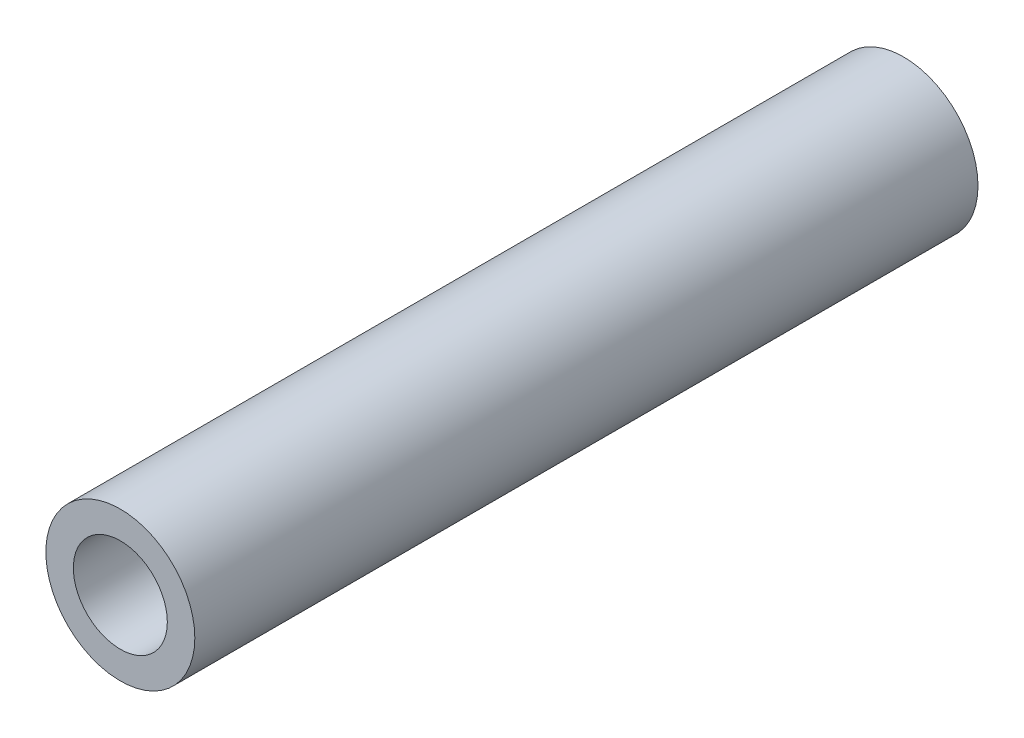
from build123d import *

# Parameters (mm, degrees)
SKIZZE1_R                       = 23.775
SKIZZE1_R_2                     = 15
AUFSATZ_LINEAR_AUSTRAGEN1_DEPTH = 250


with BuildPart() as part:
    # Skizze1 → Aufsatz-Linear austragen1 (new body)
    with BuildSketch(Plane.XY):
        Circle(SKIZZE1_R)
        Circle(SKIZZE1_R_2, mode=Mode.SUBTRACT)
    extrude(amount=AUFSATZ_LINEAR_AUSTRAGEN1_DEPTH)


solid = part.part
